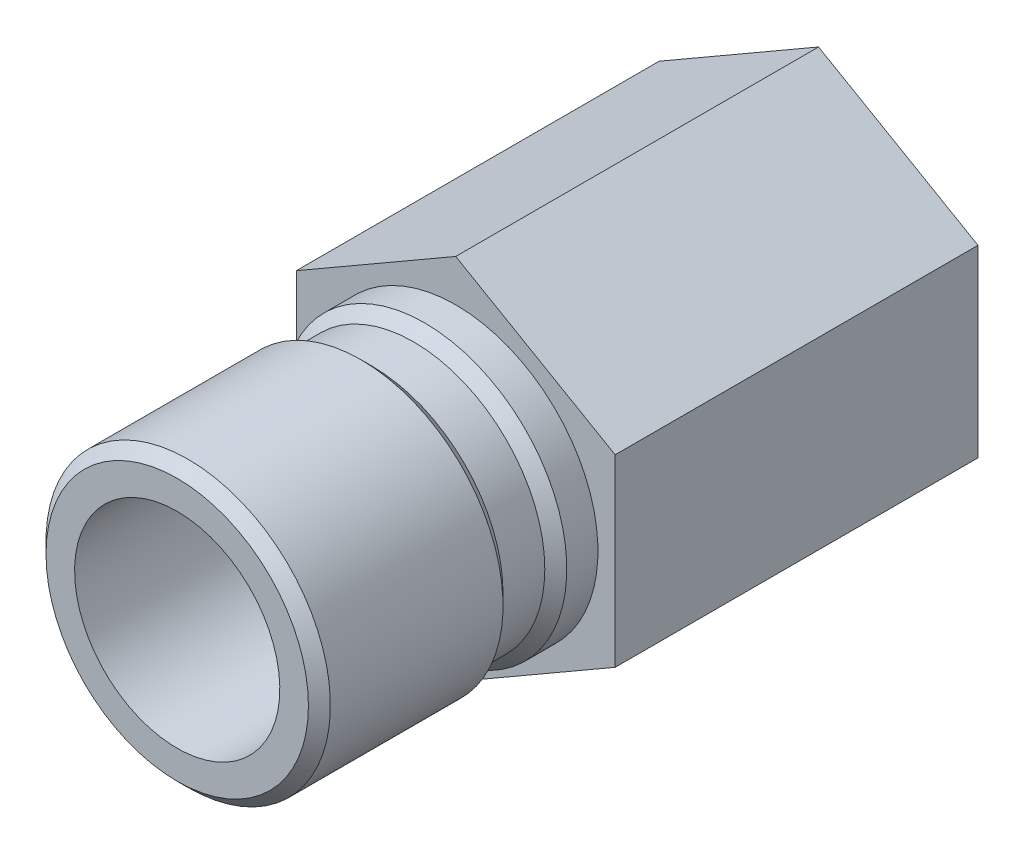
from build123d import *

# Parameters (mm, degrees)
SKETCH2_OUTSIDE_W  = 38.966
SKETCH2_OUTSIDE_H  = 38.966
CUT_EXTRUDE1_DEPTH = 31.949569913


with BuildPart() as part:
    # Sketch1 → Revolve1 (revolve)
    with BuildSketch(Plane(origin=(0, 0, 0), x_dir=(0, 0, -1), z_dir=(1, 0, 0))):
        Polygon((-19.304, 7.112), (-19.304, 9.0932), (-18.542, 9.8552), (-6.5786, 9.8552), (-5.8166, 9.0932), (-2.921, 9.0932), (-2.159, 9.8552), (0, 9.8552), (0, 12.75842), (25.146, 12.75842), (25.146, 9.405617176), (9.906, 8.92937), (8.93968723, 7.112), align=None)
    revolve(axis=Axis((0, 0, 0), (0, 0, 1)))

    # Sketch2 outside → Cut-Extrude1 (cut, through all)
    with BuildSketch(Plane.XY):
        Rectangle(SKETCH2_OUTSIDE_W, SKETCH2_OUTSIDE_H)
        Polygon((-11.049, 6.379143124), (-11.049, -6.379143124), (0, -12.758286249), (11.049, -6.379143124), (11.049, 6.379143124), (0, 12.758286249), align=None, mode=Mode.SUBTRACT)
    extrude(amount=-CUT_EXTRUDE1_DEPTH, mode=Mode.SUBTRACT)


solid = part.part
